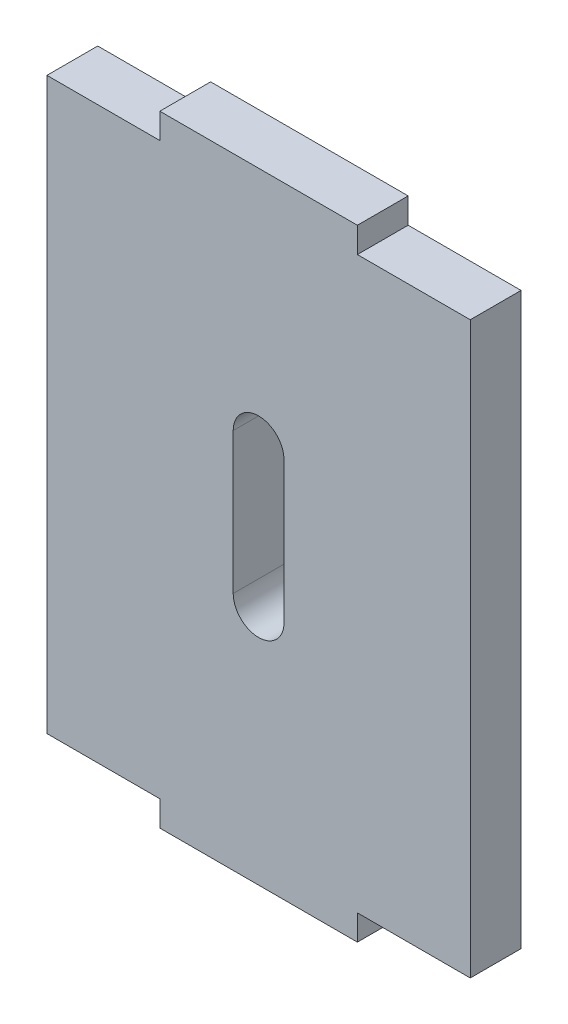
ISO-10303-21;
HEADER;
FILE_DESCRIPTION(('STEP AP214'),'2;1');
FILE_NAME('part.step','',(''),(''),'','','');
FILE_SCHEMA(('AUTOMOTIVE_DESIGN { 1 0 10303 214 1 1 1 1 }'));
ENDSEC;
DATA;
#1=APPLICATION_CONTEXT('core data for automotive mechanical design processes');
#2=APPLICATION_PROTOCOL_DEFINITION('international standard','automotive_design',2000,#1);
#3=PRODUCT_CONTEXT('',#1,'mechanical');
#4=PRODUCT('Part','Part','',(#3));
#5=PRODUCT_RELATED_PRODUCT_CATEGORY('part','',(#4));
#6=PRODUCT_DEFINITION_FORMATION('','',#4);
#7=PRODUCT_DEFINITION_CONTEXT('part definition',#1,'design');
#8=PRODUCT_DEFINITION('design','',#6,#7);
#9=PRODUCT_DEFINITION_SHAPE('','',#8);
#10=(LENGTH_UNIT() NAMED_UNIT(*) SI_UNIT(.MILLI.,.METRE.));
#11=(NAMED_UNIT(*) PLANE_ANGLE_UNIT() SI_UNIT($,.RADIAN.));
#12=(NAMED_UNIT(*) SI_UNIT($,.STERADIAN.) SOLID_ANGLE_UNIT());
#13=UNCERTAINTY_MEASURE_WITH_UNIT(LENGTH_MEASURE(1.E-05),#10,'distance_accuracy_value','');
#14=(GEOMETRIC_REPRESENTATION_CONTEXT(3) GLOBAL_UNCERTAINTY_ASSIGNED_CONTEXT((#13)) GLOBAL_UNIT_ASSIGNED_CONTEXT((#10,
#11,#12)) REPRESENTATION_CONTEXT('',''));
#15=CARTESIAN_POINT('',(0.,0.,0.));
#16=DIRECTION('',(0.,0.,1.));
#17=DIRECTION('',(1.,0.,0.));
#18=AXIS2_PLACEMENT_3D('',#15,#16,#17);
#19=CARTESIAN_POINT('',(-10.,110.,-148.));
#20=DIRECTION('',(-1.,0.,0.));
#21=DIRECTION('',(0.,0.,1.));
#22=AXIS2_PLACEMENT_3D('',#19,#20,#21);
#23=PLANE('',#22);
#24=DIRECTION('',(0.,-1.,0.));
#25=VECTOR('',#24,1.);
#26=CARTESIAN_POINT('',(-9.99999999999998,110.,-139.));
#27=LINE('',#26,#25);
#28=CARTESIAN_POINT('',(-9.99999999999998,110.,-139.));
#29=VERTEX_POINT('',#28);
#30=CARTESIAN_POINT('',(-9.99999999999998,9.,-139.));
#31=VERTEX_POINT('',#30);
#32=EDGE_CURVE('E110',#29,#31,#27,.T.);
#33=ORIENTED_EDGE('',*,*,#32,.F.);
#34=DIRECTION('',(0.,0.,1.));
#35=VECTOR('',#34,1.);
#36=CARTESIAN_POINT('',(-10.,110.,-148.));
#37=LINE('',#36,#35);
#38=CARTESIAN_POINT('',(-10.,110.,-148.));
#39=VERTEX_POINT('',#38);
#40=EDGE_CURVE('E87',#39,#29,#37,.T.);
#41=ORIENTED_EDGE('',*,*,#40,.F.);
#42=DIRECTION('',(0.,-1.,0.));
#43=VECTOR('',#42,1.);
#44=CARTESIAN_POINT('',(-10.,110.,-148.));
#45=LINE('',#44,#43);
#46=CARTESIAN_POINT('',(-10.,9.,-148.));
#47=VERTEX_POINT('',#46);
#48=EDGE_CURVE('E152',#39,#47,#45,.T.);
#49=ORIENTED_EDGE('',*,*,#48,.T.);
#50=DIRECTION('',(0.,0.,1.));
#51=VECTOR('',#50,1.);
#52=CARTESIAN_POINT('',(-10.,9.,-148.));
#53=LINE('',#52,#51);
#54=EDGE_CURVE('E185',#47,#31,#53,.T.);
#55=ORIENTED_EDGE('',*,*,#54,.T.);
#56=EDGE_LOOP('',(#33,#41,#49,#55));
#57=FACE_BOUND('',#56,.T.);
#58=ADVANCED_FACE('F36',(#57),#23,.T.);
#59=CARTESIAN_POINT('',(-10.,110.,-148.));
#60=DIRECTION('',(0.,1.,0.));
#61=DIRECTION('',(0.,0.,-1.));
#62=AXIS2_PLACEMENT_3D('',#59,#60,#61);
#63=PLANE('',#62);
#64=DIRECTION('',(-1.,0.,0.));
#65=VECTOR('',#64,1.);
#66=CARTESIAN_POINT('',(-9.99999999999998,110.,-139.));
#67=LINE('',#66,#65);
#68=CARTESIAN_POINT('',(10.,110.,-139.));
#69=VERTEX_POINT('',#68);
#70=EDGE_CURVE('E150',#69,#29,#67,.T.);
#71=ORIENTED_EDGE('',*,*,#70,.F.);
#72=DIRECTION('',(0.,0.,1.));
#73=VECTOR('',#72,1.);
#74=CARTESIAN_POINT('',(9.99999999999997,110.,-148.));
#75=LINE('',#74,#73);
#76=CARTESIAN_POINT('',(9.99999999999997,110.,-148.));
#77=VERTEX_POINT('',#76);
#78=EDGE_CURVE('E155',#77,#69,#75,.T.);
#79=ORIENTED_EDGE('',*,*,#78,.F.);
#80=DIRECTION('',(-1.,0.,0.));
#81=VECTOR('',#80,1.);
#82=CARTESIAN_POINT('',(-10.,110.,-148.));
#83=LINE('',#82,#81);
#84=EDGE_CURVE('E121',#77,#39,#83,.T.);
#85=ORIENTED_EDGE('',*,*,#84,.T.);
#86=ORIENTED_EDGE('',*,*,#40,.T.);
#87=EDGE_LOOP('',(#71,#79,#85,#86));
#88=FACE_BOUND('',#87,.T.);
#89=ADVANCED_FACE('F205',(#88),#63,.T.);
#90=CARTESIAN_POINT('',(9.99999999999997,110.,-148.));
#91=DIRECTION('',(-1.,0.,0.));
#92=DIRECTION('',(0.,0.,1.));
#93=AXIS2_PLACEMENT_3D('',#90,#91,#92);
#94=PLANE('',#93);
#95=DIRECTION('',(0.,-1.,0.));
#96=VECTOR('',#95,1.);
#97=CARTESIAN_POINT('',(10.,110.,-139.));
#98=LINE('',#97,#96);
#99=CARTESIAN_POINT('',(10.,114.5,-139.));
#100=VERTEX_POINT('',#99);
#101=EDGE_CURVE('E147',#100,#69,#98,.T.);
#102=ORIENTED_EDGE('',*,*,#101,.F.);
#103=DIRECTION('',(0.,0.,1.));
#104=VECTOR('',#103,1.);
#105=CARTESIAN_POINT('',(9.99999999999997,114.5,-148.));
#106=LINE('',#105,#104);
#107=CARTESIAN_POINT('',(9.99999999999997,114.5,-148.));
#108=VERTEX_POINT('',#107);
#109=EDGE_CURVE('E158',#108,#100,#106,.T.);
#110=ORIENTED_EDGE('',*,*,#109,.F.);
#111=DIRECTION('',(0.,-1.,0.));
#112=VECTOR('',#111,1.);
#113=CARTESIAN_POINT('',(9.99999999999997,110.,-148.));
#114=LINE('',#113,#112);
#115=EDGE_CURVE('E457',#108,#77,#114,.T.);
#116=ORIENTED_EDGE('',*,*,#115,.T.);
#117=ORIENTED_EDGE('',*,*,#78,.T.);
#118=EDGE_LOOP('',(#102,#110,#116,#117));
#119=FACE_BOUND('',#118,.T.);
#120=ADVANCED_FACE('F211',(#119),#94,.T.);
#121=CARTESIAN_POINT('',(9.99999999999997,114.5,-148.));
#122=DIRECTION('',(0.,1.,0.));
#123=DIRECTION('',(1.,0.,0.));
#124=AXIS2_PLACEMENT_3D('',#121,#122,#123);
#125=PLANE('',#124);
#126=DIRECTION('',(-1.,0.,0.));
#127=VECTOR('',#126,1.);
#128=CARTESIAN_POINT('',(10.,114.5,-139.));
#129=LINE('',#128,#127);
#130=CARTESIAN_POINT('',(45.,114.5,-139.));
#131=VERTEX_POINT('',#130);
#132=EDGE_CURVE('E144',#131,#100,#129,.T.);
#133=ORIENTED_EDGE('',*,*,#132,.F.);
#134=DIRECTION('',(0.,0.,1.));
#135=VECTOR('',#134,1.);
#136=CARTESIAN_POINT('',(45.,114.5,-148.));
#137=LINE('',#136,#135);
#138=CARTESIAN_POINT('',(45.,114.5,-148.));
#139=VERTEX_POINT('',#138);
#140=EDGE_CURVE('E161',#139,#131,#137,.T.);
#141=ORIENTED_EDGE('',*,*,#140,.F.);
#142=DIRECTION('',(-1.,0.,0.));
#143=VECTOR('',#142,1.);
#144=CARTESIAN_POINT('',(9.99999999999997,114.5,-148.));
#145=LINE('',#144,#143);
#146=EDGE_CURVE('E456',#139,#108,#145,.T.);
#147=ORIENTED_EDGE('',*,*,#146,.T.);
#148=ORIENTED_EDGE('',*,*,#109,.T.);
#149=EDGE_LOOP('',(#133,#141,#147,#148));
#150=FACE_BOUND('',#149,.T.);
#151=ADVANCED_FACE('F246',(#150),#125,.T.);
#152=CARTESIAN_POINT('',(45.,110.,-148.));
#153=DIRECTION('',(1.,0.,0.));
#154=DIRECTION('',(0.,0.,-1.));
#155=AXIS2_PLACEMENT_3D('',#152,#153,#154);
#156=PLANE('',#155);
#157=DIRECTION('',(0.,1.,0.));
#158=VECTOR('',#157,1.);
#159=CARTESIAN_POINT('',(45.,110.,-139.));
#160=LINE('',#159,#158);
#161=CARTESIAN_POINT('',(45.,110.,-139.));
#162=VERTEX_POINT('',#161);
#163=EDGE_CURVE('E141',#162,#131,#160,.T.);
#164=ORIENTED_EDGE('',*,*,#163,.F.);
#165=DIRECTION('',(0.,0.,1.));
#166=VECTOR('',#165,1.);
#167=CARTESIAN_POINT('',(45.,110.,-148.));
#168=LINE('',#167,#166);
#169=CARTESIAN_POINT('',(45.,110.,-148.));
#170=VERTEX_POINT('',#169);
#171=EDGE_CURVE('E164',#170,#162,#168,.T.);
#172=ORIENTED_EDGE('',*,*,#171,.F.);
#173=DIRECTION('',(0.,1.,0.));
#174=VECTOR('',#173,1.);
#175=CARTESIAN_POINT('',(45.,110.,-148.));
#176=LINE('',#175,#174);
#177=EDGE_CURVE('E449',#170,#139,#176,.T.);
#178=ORIENTED_EDGE('',*,*,#177,.T.);
#179=ORIENTED_EDGE('',*,*,#140,.T.);
#180=EDGE_LOOP('',(#164,#172,#178,#179));
#181=FACE_BOUND('',#180,.T.);
#182=ADVANCED_FACE('F242',(#181),#156,.T.);
#183=CARTESIAN_POINT('',(45.,110.,-148.));
#184=DIRECTION('',(0.,1.,0.));
#185=DIRECTION('',(1.,0.,0.));
#186=AXIS2_PLACEMENT_3D('',#183,#184,#185);
#187=PLANE('',#186);
#188=DIRECTION('',(-1.,0.,0.));
#189=VECTOR('',#188,1.);
#190=CARTESIAN_POINT('',(45.,110.,-139.));
#191=LINE('',#190,#189);
#192=CARTESIAN_POINT('',(65.,110.,-139.));
#193=VERTEX_POINT('',#192);
#194=EDGE_CURVE('E138',#193,#162,#191,.T.);
#195=ORIENTED_EDGE('',*,*,#194,.F.);
#196=DIRECTION('',(0.,0.,1.));
#197=VECTOR('',#196,1.);
#198=CARTESIAN_POINT('',(65.,110.,-148.));
#199=LINE('',#198,#197);
#200=CARTESIAN_POINT('',(65.,110.,-148.));
#201=VERTEX_POINT('',#200);
#202=EDGE_CURVE('E167',#201,#193,#199,.T.);
#203=ORIENTED_EDGE('',*,*,#202,.F.);
#204=DIRECTION('',(-1.,0.,0.));
#205=VECTOR('',#204,1.);
#206=CARTESIAN_POINT('',(45.,110.,-148.));
#207=LINE('',#206,#205);
#208=EDGE_CURVE('E447',#201,#170,#207,.T.);
#209=ORIENTED_EDGE('',*,*,#208,.T.);
#210=ORIENTED_EDGE('',*,*,#171,.T.);
#211=EDGE_LOOP('',(#195,#203,#209,#210));
#212=FACE_BOUND('',#211,.T.);
#213=ADVANCED_FACE('F238',(#212),#187,.T.);
#214=CARTESIAN_POINT('',(65.,110.,-148.));
#215=DIRECTION('',(1.,0.,0.));
#216=DIRECTION('',(0.,-1.,0.));
#217=AXIS2_PLACEMENT_3D('',#214,#215,#216);
#218=PLANE('',#217);
#219=DIRECTION('',(0.,1.,0.));
#220=VECTOR('',#219,1.);
#221=CARTESIAN_POINT('',(65.,110.,-139.));
#222=LINE('',#221,#220);
#223=CARTESIAN_POINT('',(65.,8.99999999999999,-139.));
#224=VERTEX_POINT('',#223);
#225=EDGE_CURVE('E135',#224,#193,#222,.T.);
#226=ORIENTED_EDGE('',*,*,#225,.F.);
#227=DIRECTION('',(0.,0.,1.));
#228=VECTOR('',#227,1.);
#229=CARTESIAN_POINT('',(65.,8.99999999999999,-148.));
#230=LINE('',#229,#228);
#231=CARTESIAN_POINT('',(65.,8.99999999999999,-148.));
#232=VERTEX_POINT('',#231);
#233=EDGE_CURVE('E170',#232,#224,#230,.T.);
#234=ORIENTED_EDGE('',*,*,#233,.F.);
#235=DIRECTION('',(0.,1.,0.));
#236=VECTOR('',#235,1.);
#237=CARTESIAN_POINT('',(65.,110.,-148.));
#238=LINE('',#237,#236);
#239=EDGE_CURVE('E435',#232,#201,#238,.T.);
#240=ORIENTED_EDGE('',*,*,#239,.T.);
#241=ORIENTED_EDGE('',*,*,#202,.T.);
#242=EDGE_LOOP('',(#226,#234,#240,#241));
#243=FACE_BOUND('',#242,.T.);
#244=ADVANCED_FACE('F234',(#243),#218,.T.);
#245=CARTESIAN_POINT('',(45.,9.,-148.));
#246=DIRECTION('',(0.,-1.,0.));
#247=DIRECTION('',(-1.,0.,0.));
#248=AXIS2_PLACEMENT_3D('',#245,#246,#247);
#249=PLANE('',#248);
#250=DIRECTION('',(1.,0.,0.));
#251=VECTOR('',#250,1.);
#252=CARTESIAN_POINT('',(45.,9.,-139.));
#253=LINE('',#252,#251);
#254=CARTESIAN_POINT('',(45.,9.,-139.));
#255=VERTEX_POINT('',#254);
#256=EDGE_CURVE('E132',#255,#224,#253,.T.);
#257=ORIENTED_EDGE('',*,*,#256,.F.);
#258=DIRECTION('',(0.,0.,1.));
#259=VECTOR('',#258,1.);
#260=CARTESIAN_POINT('',(45.,9.,-148.));
#261=LINE('',#260,#259);
#262=CARTESIAN_POINT('',(45.,9.,-148.));
#263=VERTEX_POINT('',#262);
#264=EDGE_CURVE('E173',#263,#255,#261,.T.);
#265=ORIENTED_EDGE('',*,*,#264,.F.);
#266=DIRECTION('',(1.,0.,0.));
#267=VECTOR('',#266,1.);
#268=CARTESIAN_POINT('',(45.,9.,-148.));
#269=LINE('',#268,#267);
#270=EDGE_CURVE('E442',#263,#232,#269,.T.);
#271=ORIENTED_EDGE('',*,*,#270,.T.);
#272=ORIENTED_EDGE('',*,*,#233,.T.);
#273=EDGE_LOOP('',(#257,#265,#271,#272));
#274=FACE_BOUND('',#273,.T.);
#275=ADVANCED_FACE('F230',(#274),#249,.T.);
#276=CARTESIAN_POINT('',(45.,4.5,-148.));
#277=DIRECTION('',(1.,0.,0.));
#278=DIRECTION('',(0.,0.,-1.));
#279=AXIS2_PLACEMENT_3D('',#276,#277,#278);
#280=PLANE('',#279);
#281=DIRECTION('',(0.,1.,0.));
#282=VECTOR('',#281,1.);
#283=CARTESIAN_POINT('',(45.,4.5,-139.));
#284=LINE('',#283,#282);
#285=CARTESIAN_POINT('',(45.,4.5,-139.));
#286=VERTEX_POINT('',#285);
#287=EDGE_CURVE('E129',#286,#255,#284,.T.);
#288=ORIENTED_EDGE('',*,*,#287,.F.);
#289=DIRECTION('',(0.,0.,1.));
#290=VECTOR('',#289,1.);
#291=CARTESIAN_POINT('',(45.,4.5,-148.));
#292=LINE('',#291,#290);
#293=CARTESIAN_POINT('',(45.,4.5,-148.));
#294=VERTEX_POINT('',#293);
#295=EDGE_CURVE('E176',#294,#286,#292,.T.);
#296=ORIENTED_EDGE('',*,*,#295,.F.);
#297=DIRECTION('',(0.,1.,0.));
#298=VECTOR('',#297,1.);
#299=CARTESIAN_POINT('',(45.,4.5,-148.));
#300=LINE('',#299,#298);
#301=EDGE_CURVE('E451',#294,#263,#300,.T.);
#302=ORIENTED_EDGE('',*,*,#301,.T.);
#303=ORIENTED_EDGE('',*,*,#264,.T.);
#304=EDGE_LOOP('',(#288,#296,#302,#303));
#305=FACE_BOUND('',#304,.T.);
#306=ADVANCED_FACE('F226',(#305),#280,.T.);
#307=CARTESIAN_POINT('',(9.99999999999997,4.5,-148.));
#308=DIRECTION('',(0.,-1.,0.));
#309=DIRECTION('',(0.,0.,1.));
#310=AXIS2_PLACEMENT_3D('',#307,#308,#309);
#311=PLANE('',#310);
#312=DIRECTION('',(1.,0.,0.));
#313=VECTOR('',#312,1.);
#314=CARTESIAN_POINT('',(10.,4.5,-139.));
#315=LINE('',#314,#313);
#316=CARTESIAN_POINT('',(10.,4.5,-139.));
#317=VERTEX_POINT('',#316);
#318=EDGE_CURVE('E126',#317,#286,#315,.T.);
#319=ORIENTED_EDGE('',*,*,#318,.F.);
#320=DIRECTION('',(0.,0.,1.));
#321=VECTOR('',#320,1.);
#322=CARTESIAN_POINT('',(9.99999999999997,4.5,-148.));
#323=LINE('',#322,#321);
#324=CARTESIAN_POINT('',(9.99999999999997,4.5,-148.));
#325=VERTEX_POINT('',#324);
#326=EDGE_CURVE('E179',#325,#317,#323,.T.);
#327=ORIENTED_EDGE('',*,*,#326,.F.);
#328=DIRECTION('',(1.,0.,0.));
#329=VECTOR('',#328,1.);
#330=CARTESIAN_POINT('',(9.99999999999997,4.5,-148.));
#331=LINE('',#330,#329);
#332=EDGE_CURVE('E468',#325,#294,#331,.T.);
#333=ORIENTED_EDGE('',*,*,#332,.T.);
#334=ORIENTED_EDGE('',*,*,#295,.T.);
#335=EDGE_LOOP('',(#319,#327,#333,#334));
#336=FACE_BOUND('',#335,.T.);
#337=ADVANCED_FACE('F222',(#336),#311,.T.);
#338=CARTESIAN_POINT('',(9.99999999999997,4.5,-148.));
#339=DIRECTION('',(-1.,0.,0.));
#340=DIRECTION('',(0.,0.,1.));
#341=AXIS2_PLACEMENT_3D('',#338,#339,#340);
#342=PLANE('',#341);
#343=DIRECTION('',(0.,-1.,0.));
#344=VECTOR('',#343,1.);
#345=CARTESIAN_POINT('',(10.,4.5,-139.));
#346=LINE('',#345,#344);
#347=CARTESIAN_POINT('',(10.,9.,-139.));
#348=VERTEX_POINT('',#347);
#349=EDGE_CURVE('E118',#348,#317,#346,.T.);
#350=ORIENTED_EDGE('',*,*,#349,.F.);
#351=DIRECTION('',(0.,0.,1.));
#352=VECTOR('',#351,1.);
#353=CARTESIAN_POINT('',(9.99999999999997,9.,-148.));
#354=LINE('',#353,#352);
#355=CARTESIAN_POINT('',(9.99999999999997,9.,-148.));
#356=VERTEX_POINT('',#355);
#357=EDGE_CURVE('E182',#356,#348,#354,.T.);
#358=ORIENTED_EDGE('',*,*,#357,.F.);
#359=DIRECTION('',(0.,-1.,0.));
#360=VECTOR('',#359,1.);
#361=CARTESIAN_POINT('',(9.99999999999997,4.5,-148.));
#362=LINE('',#361,#360);
#363=EDGE_CURVE('E463',#356,#325,#362,.T.);
#364=ORIENTED_EDGE('',*,*,#363,.T.);
#365=ORIENTED_EDGE('',*,*,#326,.T.);
#366=EDGE_LOOP('',(#350,#358,#364,#365));
#367=FACE_BOUND('',#366,.T.);
#368=ADVANCED_FACE('F218',(#367),#342,.T.);
#369=CARTESIAN_POINT('',(-10.,9.,-148.));
#370=DIRECTION('',(0.,-1.,0.));
#371=DIRECTION('',(-1.,0.,0.));
#372=AXIS2_PLACEMENT_3D('',#369,#370,#371);
#373=PLANE('',#372);
#374=DIRECTION('',(1.,0.,0.));
#375=VECTOR('',#374,1.);
#376=CARTESIAN_POINT('',(-9.99999999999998,9.,-139.));
#377=LINE('',#376,#375);
#378=EDGE_CURVE('E113',#31,#348,#377,.T.);
#379=ORIENTED_EDGE('',*,*,#378,.F.);
#380=ORIENTED_EDGE('',*,*,#54,.F.);
#381=DIRECTION('',(1.,0.,0.));
#382=VECTOR('',#381,1.);
#383=CARTESIAN_POINT('',(-10.,9.,-148.));
#384=LINE('',#383,#382);
#385=EDGE_CURVE('E461',#47,#356,#384,.T.);
#386=ORIENTED_EDGE('',*,*,#385,.T.);
#387=ORIENTED_EDGE('',*,*,#357,.T.);
#388=EDGE_LOOP('',(#379,#380,#386,#387));
#389=FACE_BOUND('',#388,.T.);
#390=ADVANCED_FACE('F215',(#389),#373,.T.);
#391=CARTESIAN_POINT('',(55.,0.,-148.));
#392=DIRECTION('',(0.,0.,1.));
#393=DIRECTION('',(1.,0.,0.));
#394=AXIS2_PLACEMENT_3D('',#391,#392,#393);
#395=PLANE('',#394);
#396=DIRECTION('',(0.,1.,0.));
#397=VECTOR('',#396,1.);
#398=CARTESIAN_POINT('',(32.,-20.,-148.));
#399=LINE('',#398,#397);
#400=CARTESIAN_POINT('',(32.,47.,-148.));
#401=VERTEX_POINT('',#400);
#402=CARTESIAN_POINT('',(32.,72.,-148.));
#403=VERTEX_POINT('',#402);
#404=EDGE_CURVE('E106',#401,#403,#399,.T.);
#405=ORIENTED_EDGE('',*,*,#404,.T.);
#406=CARTESIAN_POINT('',(27.5,72.,-148.));
#407=DIRECTION('',(0.,0.,1.));
#408=DIRECTION('',(1.,0.,0.));
#409=AXIS2_PLACEMENT_3D('',#406,#407,#408);
#410=CIRCLE('',#409,4.5);
#411=CARTESIAN_POINT('',(23.,72.,-148.));
#412=VERTEX_POINT('',#411);
#413=EDGE_CURVE('E108',#403,#412,#410,.T.);
#414=ORIENTED_EDGE('',*,*,#413,.T.);
#415=DIRECTION('',(0.,-1.,0.));
#416=VECTOR('',#415,1.);
#417=CARTESIAN_POINT('',(23.,-20.,-148.));
#418=LINE('',#417,#416);
#419=CARTESIAN_POINT('',(23.,47.,-148.));
#420=VERTEX_POINT('',#419);
#421=EDGE_CURVE('E40',#412,#420,#418,.T.);
#422=ORIENTED_EDGE('',*,*,#421,.T.);
#423=CARTESIAN_POINT('',(27.5,47.,-148.));
#424=DIRECTION('',(0.,0.,1.));
#425=DIRECTION('',(1.,0.,0.));
#426=AXIS2_PLACEMENT_3D('',#423,#424,#425);
#427=CIRCLE('',#426,4.5);
#428=EDGE_CURVE('E94',#420,#401,#427,.T.);
#429=ORIENTED_EDGE('',*,*,#428,.T.);
#430=EDGE_LOOP('',(#405,#414,#422,#429));
#431=FACE_BOUND('',#430,.T.);
#432=ORIENTED_EDGE('',*,*,#48,.F.);
#433=ORIENTED_EDGE('',*,*,#84,.F.);
#434=ORIENTED_EDGE('',*,*,#115,.F.);
#435=ORIENTED_EDGE('',*,*,#146,.F.);
#436=ORIENTED_EDGE('',*,*,#177,.F.);
#437=ORIENTED_EDGE('',*,*,#208,.F.);
#438=ORIENTED_EDGE('',*,*,#239,.F.);
#439=ORIENTED_EDGE('',*,*,#270,.F.);
#440=ORIENTED_EDGE('',*,*,#301,.F.);
#441=ORIENTED_EDGE('',*,*,#332,.F.);
#442=ORIENTED_EDGE('',*,*,#363,.F.);
#443=ORIENTED_EDGE('',*,*,#385,.F.);
#444=EDGE_LOOP('',(#432,#433,#434,#435,#436,#437,#438,#439,#440,#441,#442,#443));
#445=FACE_BOUND('',#444,.T.);
#446=ADVANCED_FACE('F192',(#431,#445),#395,.F.);
#447=CARTESIAN_POINT('',(55.,0.,-139.));
#448=DIRECTION('',(0.,0.,1.));
#449=DIRECTION('',(1.,0.,0.));
#450=AXIS2_PLACEMENT_3D('',#447,#448,#449);
#451=PLANE('',#450);
#452=CARTESIAN_POINT('',(27.5,72.,-139.));
#453=DIRECTION('',(0.,0.,1.));
#454=DIRECTION('',(1.,0.,0.));
#455=AXIS2_PLACEMENT_3D('',#452,#453,#454);
#456=CIRCLE('',#455,4.5);
#457=CARTESIAN_POINT('',(32.,72.,-139.));
#458=VERTEX_POINT('',#457);
#459=CARTESIAN_POINT('',(23.,72.,-139.));
#460=VERTEX_POINT('',#459);
#461=EDGE_CURVE('E12',#458,#460,#456,.T.);
#462=ORIENTED_EDGE('',*,*,#461,.F.);
#463=DIRECTION('',(0.,1.,0.));
#464=VECTOR('',#463,1.);
#465=CARTESIAN_POINT('',(32.,-20.,-139.));
#466=LINE('',#465,#464);
#467=CARTESIAN_POINT('',(32.,47.,-139.));
#468=VERTEX_POINT('',#467);
#469=EDGE_CURVE('E45',#468,#458,#466,.T.);
#470=ORIENTED_EDGE('',*,*,#469,.F.);
#471=CARTESIAN_POINT('',(27.5,47.,-139.));
#472=DIRECTION('',(0.,0.,1.));
#473=DIRECTION('',(1.,0.,0.));
#474=AXIS2_PLACEMENT_3D('',#471,#472,#473);
#475=CIRCLE('',#474,4.5);
#476=CARTESIAN_POINT('',(23.,47.,-139.));
#477=VERTEX_POINT('',#476);
#478=EDGE_CURVE('E86',#477,#468,#475,.T.);
#479=ORIENTED_EDGE('',*,*,#478,.F.);
#480=DIRECTION('',(0.,-1.,0.));
#481=VECTOR('',#480,1.);
#482=CARTESIAN_POINT('',(23.,-20.,-139.));
#483=LINE('',#482,#481);
#484=EDGE_CURVE('E82',#460,#477,#483,.T.);
#485=ORIENTED_EDGE('',*,*,#484,.F.);
#486=EDGE_LOOP('',(#462,#470,#479,#485));
#487=FACE_BOUND('',#486,.T.);
#488=ORIENTED_EDGE('',*,*,#32,.T.);
#489=ORIENTED_EDGE('',*,*,#378,.T.);
#490=ORIENTED_EDGE('',*,*,#349,.T.);
#491=ORIENTED_EDGE('',*,*,#318,.T.);
#492=ORIENTED_EDGE('',*,*,#287,.T.);
#493=ORIENTED_EDGE('',*,*,#256,.T.);
#494=ORIENTED_EDGE('',*,*,#225,.T.);
#495=ORIENTED_EDGE('',*,*,#194,.T.);
#496=ORIENTED_EDGE('',*,*,#163,.T.);
#497=ORIENTED_EDGE('',*,*,#132,.T.);
#498=ORIENTED_EDGE('',*,*,#101,.T.);
#499=ORIENTED_EDGE('',*,*,#70,.T.);
#500=EDGE_LOOP('',(#488,#489,#490,#491,#492,#493,#494,#495,#496,#497,#498,#499));
#501=FACE_BOUND('',#500,.T.);
#502=ADVANCED_FACE('F98',(#487,#501),#451,.T.);
#503=CARTESIAN_POINT('',(27.4999999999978,72.,-455.));
#504=DIRECTION('',(0.,0.,1.));
#505=DIRECTION('',(1.,0.,0.));
#506=AXIS2_PLACEMENT_3D('',#503,#504,#505);
#507=CYLINDRICAL_SURFACE('',#506,4.5);
#508=DIRECTION('',(0.,0.,1.));
#509=VECTOR('',#508,1.);
#510=CARTESIAN_POINT('',(31.9999999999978,72.,-455.));
#511=LINE('',#510,#509);
#512=EDGE_CURVE('E188',#403,#458,#511,.T.);
#513=ORIENTED_EDGE('',*,*,#512,.T.);
#514=ORIENTED_EDGE('',*,*,#461,.T.);
#515=DIRECTION('',(0.,0.,1.));
#516=VECTOR('',#515,1.);
#517=CARTESIAN_POINT('',(22.9999999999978,72.,-455.));
#518=LINE('',#517,#516);
#519=EDGE_CURVE('E59',#412,#460,#518,.T.);
#520=ORIENTED_EDGE('',*,*,#519,.F.);
#521=ORIENTED_EDGE('',*,*,#413,.F.);
#522=EDGE_LOOP('',(#513,#514,#520,#521));
#523=FACE_BOUND('',#522,.T.);
#524=ADVANCED_FACE('F197',(#523),#507,.F.);
#525=CARTESIAN_POINT('',(31.9999999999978,72.,-455.));
#526=DIRECTION('',(1.,0.,0.));
#527=DIRECTION('',(0.,0.,-1.));
#528=AXIS2_PLACEMENT_3D('',#525,#526,#527);
#529=PLANE('',#528);
#530=DIRECTION('',(0.,0.,1.));
#531=VECTOR('',#530,1.);
#532=CARTESIAN_POINT('',(31.9999999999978,47.,-455.));
#533=LINE('',#532,#531);
#534=EDGE_CURVE('E95',#401,#468,#533,.T.);
#535=ORIENTED_EDGE('',*,*,#534,.T.);
#536=ORIENTED_EDGE('',*,*,#469,.T.);
#537=ORIENTED_EDGE('',*,*,#512,.F.);
#538=ORIENTED_EDGE('',*,*,#404,.F.);
#539=EDGE_LOOP('',(#535,#536,#537,#538));
#540=FACE_BOUND('',#539,.T.);
#541=ADVANCED_FACE('F195',(#540),#529,.F.);
#542=CARTESIAN_POINT('',(27.4999999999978,47.,-455.));
#543=DIRECTION('',(0.,0.,1.));
#544=DIRECTION('',(1.,0.,0.));
#545=AXIS2_PLACEMENT_3D('',#542,#543,#544);
#546=CYLINDRICAL_SURFACE('',#545,4.5);
#547=DIRECTION('',(0.,0.,1.));
#548=VECTOR('',#547,1.);
#549=CARTESIAN_POINT('',(22.9999999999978,47.,-455.));
#550=LINE('',#549,#548);
#551=EDGE_CURVE('E53',#420,#477,#550,.T.);
#552=ORIENTED_EDGE('',*,*,#551,.T.);
#553=ORIENTED_EDGE('',*,*,#478,.T.);
#554=ORIENTED_EDGE('',*,*,#534,.F.);
#555=ORIENTED_EDGE('',*,*,#428,.F.);
#556=EDGE_LOOP('',(#552,#553,#554,#555));
#557=FACE_BOUND('',#556,.T.);
#558=ADVANCED_FACE('F90',(#557),#546,.F.);
#559=CARTESIAN_POINT('',(22.9999999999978,72.,-455.));
#560=DIRECTION('',(-1.,0.,0.));
#561=DIRECTION('',(0.,1.,0.));
#562=AXIS2_PLACEMENT_3D('',#559,#560,#561);
#563=PLANE('',#562);
#564=ORIENTED_EDGE('',*,*,#519,.T.);
#565=ORIENTED_EDGE('',*,*,#484,.T.);
#566=ORIENTED_EDGE('',*,*,#551,.F.);
#567=ORIENTED_EDGE('',*,*,#421,.F.);
#568=EDGE_LOOP('',(#564,#565,#566,#567));
#569=FACE_BOUND('',#568,.T.);
#570=ADVANCED_FACE('F38',(#569),#563,.F.);
#571=CLOSED_SHELL('',(#58,#89,#120,#151,#182,#213,#244,#275,#306,#337,#368,#390,#446,#502,#524,
#541,#558,#570));
#572=MANIFOLD_SOLID_BREP('B2',#571);
#573=ADVANCED_BREP_SHAPE_REPRESENTATION('',(#18,#572),#14);
#574=SHAPE_DEFINITION_REPRESENTATION(#9,#573);
ENDSEC;
END-ISO-10303-21;
